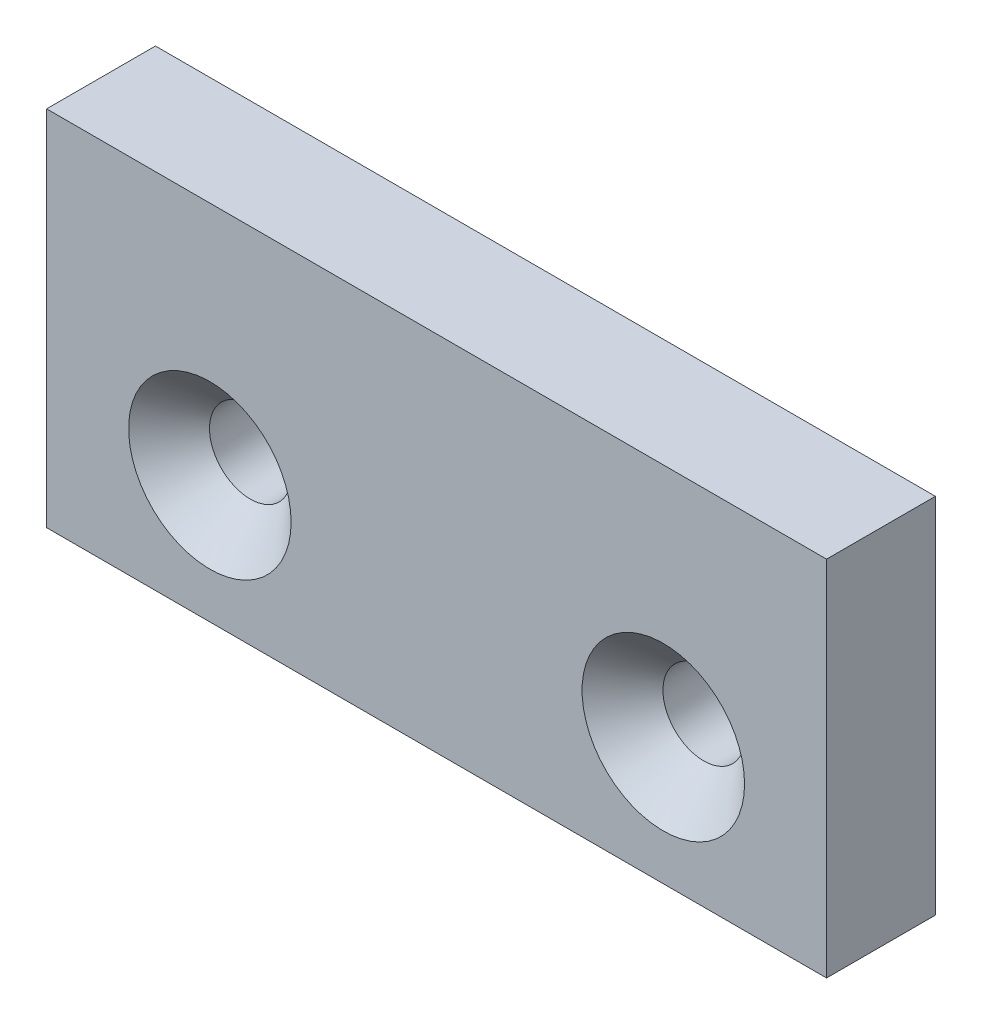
ISO-10303-21;
HEADER;
FILE_DESCRIPTION(('STEP AP214'),'2;1');
FILE_NAME('part.step','',(''),(''),'','','');
FILE_SCHEMA(('AUTOMOTIVE_DESIGN { 1 0 10303 214 1 1 1 1 }'));
ENDSEC;
DATA;
#1=APPLICATION_CONTEXT('core data for automotive mechanical design processes');
#2=APPLICATION_PROTOCOL_DEFINITION('international standard','automotive_design',2000,#1);
#3=PRODUCT_CONTEXT('',#1,'mechanical');
#4=PRODUCT('Part','Part','',(#3));
#5=PRODUCT_RELATED_PRODUCT_CATEGORY('part','',(#4));
#6=PRODUCT_DEFINITION_FORMATION('','',#4);
#7=PRODUCT_DEFINITION_CONTEXT('part definition',#1,'design');
#8=PRODUCT_DEFINITION('design','',#6,#7);
#9=PRODUCT_DEFINITION_SHAPE('','',#8);
#10=(LENGTH_UNIT() NAMED_UNIT(*) SI_UNIT(.MILLI.,.METRE.));
#11=(NAMED_UNIT(*) PLANE_ANGLE_UNIT() SI_UNIT($,.RADIAN.));
#12=(NAMED_UNIT(*) SI_UNIT($,.STERADIAN.) SOLID_ANGLE_UNIT());
#13=UNCERTAINTY_MEASURE_WITH_UNIT(LENGTH_MEASURE(1.E-05),#10,'distance_accuracy_value','');
#14=(GEOMETRIC_REPRESENTATION_CONTEXT(3) GLOBAL_UNCERTAINTY_ASSIGNED_CONTEXT((#13)) GLOBAL_UNIT_ASSIGNED_CONTEXT((#10,
#11,#12)) REPRESENTATION_CONTEXT('',''));
#15=CARTESIAN_POINT('',(0.,0.,0.));
#16=DIRECTION('',(0.,0.,1.));
#17=DIRECTION('',(1.,0.,0.));
#18=AXIS2_PLACEMENT_3D('',#15,#16,#17);
#19=CARTESIAN_POINT('',(0.,0.,6.));
#20=DIRECTION('',(1.,0.,0.));
#21=DIRECTION('',(0.,1.,0.));
#22=AXIS2_PLACEMENT_3D('',#19,#20,#21);
#23=PLANE('',#22);
#24=DIRECTION('',(0.,-1.,0.));
#25=VECTOR('',#24,1.);
#26=CARTESIAN_POINT('',(0.,0.,0.));
#27=LINE('',#26,#25);
#28=CARTESIAN_POINT('',(0.,0.,0.));
#29=VERTEX_POINT('',#28);
#30=CARTESIAN_POINT('',(0.,-20.,0.));
#31=VERTEX_POINT('',#30);
#32=EDGE_CURVE('E94',#29,#31,#27,.T.);
#33=ORIENTED_EDGE('',*,*,#32,.T.);
#34=DIRECTION('',(0.,0.,-1.));
#35=VECTOR('',#34,1.);
#36=CARTESIAN_POINT('',(0.,-20.,6.));
#37=LINE('',#36,#35);
#38=CARTESIAN_POINT('',(0.,-20.,6.));
#39=VERTEX_POINT('',#38);
#40=EDGE_CURVE('E11',#39,#31,#37,.T.);
#41=ORIENTED_EDGE('',*,*,#40,.F.);
#42=DIRECTION('',(0.,-1.,0.));
#43=VECTOR('',#42,1.);
#44=CARTESIAN_POINT('',(0.,0.,6.));
#45=LINE('',#44,#43);
#46=CARTESIAN_POINT('',(0.,0.,6.));
#47=VERTEX_POINT('',#46);
#48=EDGE_CURVE('E82',#47,#39,#45,.T.);
#49=ORIENTED_EDGE('',*,*,#48,.F.);
#50=DIRECTION('',(0.,0.,-1.));
#51=VECTOR('',#50,1.);
#52=CARTESIAN_POINT('',(0.,0.,6.));
#53=LINE('',#52,#51);
#54=EDGE_CURVE('E90',#47,#29,#53,.T.);
#55=ORIENTED_EDGE('',*,*,#54,.T.);
#56=EDGE_LOOP('',(#33,#41,#49,#55));
#57=FACE_BOUND('',#56,.T.);
#58=ADVANCED_FACE('F31',(#57),#23,.F.);
#59=CARTESIAN_POINT('',(0.,-20.,6.));
#60=DIRECTION('',(0.,1.,0.));
#61=DIRECTION('',(0.,0.,1.));
#62=AXIS2_PLACEMENT_3D('',#59,#60,#61);
#63=PLANE('',#62);
#64=DIRECTION('',(1.,0.,0.));
#65=VECTOR('',#64,1.);
#66=CARTESIAN_POINT('',(0.,-20.,0.));
#67=LINE('',#66,#65);
#68=CARTESIAN_POINT('',(43.,-20.,0.));
#69=VERTEX_POINT('',#68);
#70=EDGE_CURVE('E86',#31,#69,#67,.T.);
#71=ORIENTED_EDGE('',*,*,#70,.T.);
#72=DIRECTION('',(0.,0.,-1.));
#73=VECTOR('',#72,1.);
#74=CARTESIAN_POINT('',(43.,-20.,6.));
#75=LINE('',#74,#73);
#76=CARTESIAN_POINT('',(43.,-20.,6.));
#77=VERTEX_POINT('',#76);
#78=EDGE_CURVE('E39',#77,#69,#75,.T.);
#79=ORIENTED_EDGE('',*,*,#78,.F.);
#80=DIRECTION('',(1.,0.,0.));
#81=VECTOR('',#80,1.);
#82=CARTESIAN_POINT('',(0.,-20.,6.));
#83=LINE('',#82,#81);
#84=EDGE_CURVE('E77',#39,#77,#83,.T.);
#85=ORIENTED_EDGE('',*,*,#84,.F.);
#86=ORIENTED_EDGE('',*,*,#40,.T.);
#87=EDGE_LOOP('',(#71,#79,#85,#86));
#88=FACE_BOUND('',#87,.T.);
#89=ADVANCED_FACE('F85',(#88),#63,.F.);
#90=CARTESIAN_POINT('',(43.,0.,6.));
#91=DIRECTION('',(-1.,0.,0.));
#92=DIRECTION('',(0.,0.,1.));
#93=AXIS2_PLACEMENT_3D('',#90,#91,#92);
#94=PLANE('',#93);
#95=DIRECTION('',(0.,1.,0.));
#96=VECTOR('',#95,1.);
#97=CARTESIAN_POINT('',(43.,0.,0.));
#98=LINE('',#97,#96);
#99=CARTESIAN_POINT('',(43.,0.,0.));
#100=VERTEX_POINT('',#99);
#101=EDGE_CURVE('E64',#69,#100,#98,.T.);
#102=ORIENTED_EDGE('',*,*,#101,.T.);
#103=DIRECTION('',(0.,0.,-1.));
#104=VECTOR('',#103,1.);
#105=CARTESIAN_POINT('',(43.,0.,6.));
#106=LINE('',#105,#104);
#107=CARTESIAN_POINT('',(43.,0.,6.));
#108=VERTEX_POINT('',#107);
#109=EDGE_CURVE('E87',#108,#100,#106,.T.);
#110=ORIENTED_EDGE('',*,*,#109,.F.);
#111=DIRECTION('',(0.,1.,0.));
#112=VECTOR('',#111,1.);
#113=CARTESIAN_POINT('',(43.,0.,6.));
#114=LINE('',#113,#112);
#115=EDGE_CURVE('E80',#77,#108,#114,.T.);
#116=ORIENTED_EDGE('',*,*,#115,.F.);
#117=ORIENTED_EDGE('',*,*,#78,.T.);
#118=EDGE_LOOP('',(#102,#110,#116,#117));
#119=FACE_BOUND('',#118,.T.);
#120=ADVANCED_FACE('F88',(#119),#94,.F.);
#121=CARTESIAN_POINT('',(0.,0.,6.));
#122=DIRECTION('',(0.,-1.,0.));
#123=DIRECTION('',(0.,0.,-1.));
#124=AXIS2_PLACEMENT_3D('',#121,#122,#123);
#125=PLANE('',#124);
#126=DIRECTION('',(-1.,0.,0.));
#127=VECTOR('',#126,1.);
#128=CARTESIAN_POINT('',(0.,0.,0.));
#129=LINE('',#128,#127);
#130=EDGE_CURVE('E70',#100,#29,#129,.T.);
#131=ORIENTED_EDGE('',*,*,#130,.T.);
#132=ORIENTED_EDGE('',*,*,#54,.F.);
#133=DIRECTION('',(-1.,0.,0.));
#134=VECTOR('',#133,1.);
#135=CARTESIAN_POINT('',(0.,0.,6.));
#136=LINE('',#135,#134);
#137=EDGE_CURVE('E47',#108,#47,#136,.T.);
#138=ORIENTED_EDGE('',*,*,#137,.F.);
#139=ORIENTED_EDGE('',*,*,#109,.T.);
#140=EDGE_LOOP('',(#131,#132,#138,#139));
#141=FACE_BOUND('',#140,.T.);
#142=ADVANCED_FACE('F102',(#141),#125,.F.);
#143=CARTESIAN_POINT('',(0.,-20.,6.));
#144=DIRECTION('',(0.,0.,1.));
#145=DIRECTION('',(1.,0.,0.));
#146=AXIS2_PLACEMENT_3D('',#143,#144,#145);
#147=PLANE('',#146);
#148=CARTESIAN_POINT('',(9.,-13.,6.));
#149=DIRECTION('',(0.,0.,1.));
#150=DIRECTION('',(1.,0.,0.));
#151=AXIS2_PLACEMENT_3D('',#148,#149,#150);
#152=CIRCLE('',#151,4.48);
#153=CARTESIAN_POINT('',(13.48,-13.,6.));
#154=VERTEX_POINT('',#153);
#155=EDGE_CURVE('E116',#154,#154,#152,.T.);
#156=ORIENTED_EDGE('',*,*,#155,.F.);
#157=EDGE_LOOP('',(#156));
#158=FACE_BOUND('',#157,.T.);
#159=CARTESIAN_POINT('',(34.,-13.,6.));
#160=DIRECTION('',(0.,0.,1.));
#161=DIRECTION('',(1.,0.,0.));
#162=AXIS2_PLACEMENT_3D('',#159,#160,#161);
#163=CIRCLE('',#162,4.48);
#164=CARTESIAN_POINT('',(38.48,-13.,6.));
#165=VERTEX_POINT('',#164);
#166=EDGE_CURVE('E97',#165,#165,#163,.T.);
#167=ORIENTED_EDGE('',*,*,#166,.F.);
#168=EDGE_LOOP('',(#167));
#169=FACE_BOUND('',#168,.T.);
#170=ORIENTED_EDGE('',*,*,#48,.T.);
#171=ORIENTED_EDGE('',*,*,#84,.T.);
#172=ORIENTED_EDGE('',*,*,#115,.T.);
#173=ORIENTED_EDGE('',*,*,#137,.T.);
#174=EDGE_LOOP('',(#170,#171,#172,#173));
#175=FACE_BOUND('',#174,.T.);
#176=ADVANCED_FACE('F78',(#158,#169,#175),#147,.T.);
#177=CARTESIAN_POINT('',(0.,-20.,0.));
#178=DIRECTION('',(0.,0.,1.));
#179=DIRECTION('',(1.,0.,0.));
#180=AXIS2_PLACEMENT_3D('',#177,#178,#179);
#181=PLANE('',#180);
#182=CARTESIAN_POINT('',(9.,-13.,0.));
#183=DIRECTION('',(0.,0.,1.));
#184=DIRECTION('',(1.,0.,0.));
#185=AXIS2_PLACEMENT_3D('',#182,#183,#184);
#186=CIRCLE('',#185,2.25);
#187=CARTESIAN_POINT('',(11.25,-13.,0.));
#188=VERTEX_POINT('',#187);
#189=EDGE_CURVE('E122',#188,#188,#186,.T.);
#190=ORIENTED_EDGE('',*,*,#189,.T.);
#191=EDGE_LOOP('',(#190));
#192=FACE_BOUND('',#191,.T.);
#193=CARTESIAN_POINT('',(34.,-13.,0.));
#194=DIRECTION('',(0.,0.,1.));
#195=DIRECTION('',(1.,0.,0.));
#196=AXIS2_PLACEMENT_3D('',#193,#194,#195);
#197=CIRCLE('',#196,2.25);
#198=CARTESIAN_POINT('',(36.25,-13.,0.));
#199=VERTEX_POINT('',#198);
#200=EDGE_CURVE('E113',#199,#199,#197,.T.);
#201=ORIENTED_EDGE('',*,*,#200,.T.);
#202=EDGE_LOOP('',(#201));
#203=FACE_BOUND('',#202,.T.);
#204=ORIENTED_EDGE('',*,*,#32,.F.);
#205=ORIENTED_EDGE('',*,*,#130,.F.);
#206=ORIENTED_EDGE('',*,*,#101,.F.);
#207=ORIENTED_EDGE('',*,*,#70,.F.);
#208=EDGE_LOOP('',(#204,#205,#206,#207));
#209=FACE_BOUND('',#208,.T.);
#210=ADVANCED_FACE('F105',(#192,#203,#209),#181,.F.);
#211=CARTESIAN_POINT('',(34.,-13.,6.));
#212=DIRECTION('',(0.,0.,1.));
#213=DIRECTION('',(1.,0.,0.));
#214=AXIS2_PLACEMENT_3D('',#211,#212,#213);
#215=CONICAL_SURFACE('',#214,4.48,0.785398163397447);
#216=CARTESIAN_POINT('',(34.,-13.,3.77));
#217=DIRECTION('',(0.,0.,1.));
#218=DIRECTION('',(1.,0.,0.));
#219=AXIS2_PLACEMENT_3D('',#216,#217,#218);
#220=CIRCLE('',#219,2.25);
#221=CARTESIAN_POINT('',(36.25,-13.,3.77));
#222=VERTEX_POINT('',#221);
#223=EDGE_CURVE('E110',#222,#222,#220,.T.);
#224=ORIENTED_EDGE('',*,*,#223,.F.);
#225=EDGE_LOOP('',(#224));
#226=FACE_BOUND('',#225,.T.);
#227=ORIENTED_EDGE('',*,*,#166,.T.);
#228=EDGE_LOOP('',(#227));
#229=FACE_BOUND('',#228,.T.);
#230=ADVANCED_FACE('F146',(#226,#229),#215,.F.);
#231=CARTESIAN_POINT('',(34.,-13.,6.));
#232=DIRECTION('',(0.,0.,1.));
#233=DIRECTION('',(1.,0.,0.));
#234=AXIS2_PLACEMENT_3D('',#231,#232,#233);
#235=CYLINDRICAL_SURFACE('',#234,2.25);
#236=ORIENTED_EDGE('',*,*,#200,.F.);
#237=EDGE_LOOP('',(#236));
#238=FACE_BOUND('',#237,.T.);
#239=ORIENTED_EDGE('',*,*,#223,.T.);
#240=EDGE_LOOP('',(#239));
#241=FACE_BOUND('',#240,.T.);
#242=ADVANCED_FACE('F137',(#238,#241),#235,.F.);
#243=CARTESIAN_POINT('',(9.,-13.,6.));
#244=DIRECTION('',(0.,0.,1.));
#245=DIRECTION('',(1.,0.,0.));
#246=AXIS2_PLACEMENT_3D('',#243,#244,#245);
#247=CONICAL_SURFACE('',#246,4.48,0.785398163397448);
#248=CARTESIAN_POINT('',(9.,-13.,3.77));
#249=DIRECTION('',(0.,0.,1.));
#250=DIRECTION('',(1.,0.,0.));
#251=AXIS2_PLACEMENT_3D('',#248,#249,#250);
#252=CIRCLE('',#251,2.25);
#253=CARTESIAN_POINT('',(11.25,-13.,3.77));
#254=VERTEX_POINT('',#253);
#255=EDGE_CURVE('E119',#254,#254,#252,.T.);
#256=ORIENTED_EDGE('',*,*,#255,.F.);
#257=EDGE_LOOP('',(#256));
#258=FACE_BOUND('',#257,.T.);
#259=ORIENTED_EDGE('',*,*,#155,.T.);
#260=EDGE_LOOP('',(#259));
#261=FACE_BOUND('',#260,.T.);
#262=ADVANCED_FACE('F131',(#258,#261),#247,.F.);
#263=CARTESIAN_POINT('',(9.,-13.,6.));
#264=DIRECTION('',(0.,0.,1.));
#265=DIRECTION('',(1.,0.,0.));
#266=AXIS2_PLACEMENT_3D('',#263,#264,#265);
#267=CYLINDRICAL_SURFACE('',#266,2.25);
#268=ORIENTED_EDGE('',*,*,#189,.F.);
#269=EDGE_LOOP('',(#268));
#270=FACE_BOUND('',#269,.T.);
#271=ORIENTED_EDGE('',*,*,#255,.T.);
#272=EDGE_LOOP('',(#271));
#273=FACE_BOUND('',#272,.T.);
#274=ADVANCED_FACE('F128',(#270,#273),#267,.F.);
#275=CLOSED_SHELL('',(#58,#89,#120,#142,#176,#210,#230,#242,#262,#274));
#276=MANIFOLD_SOLID_BREP('B2',#275);
#277=ADVANCED_BREP_SHAPE_REPRESENTATION('',(#18,#276),#14);
#278=SHAPE_DEFINITION_REPRESENTATION(#9,#277);
ENDSEC;
END-ISO-10303-21;
